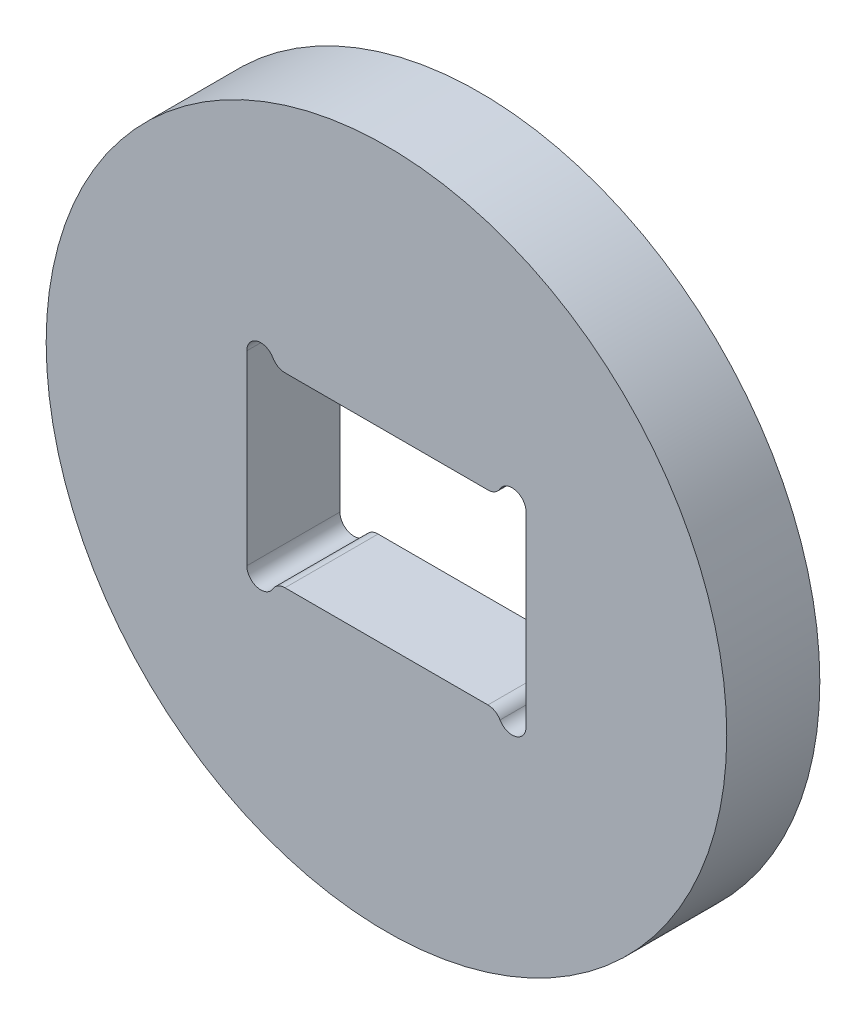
ISO-10303-21;
HEADER;
FILE_DESCRIPTION(('STEP AP214'),'2;1');
FILE_NAME('part.step','',(''),(''),'','','');
FILE_SCHEMA(('AUTOMOTIVE_DESIGN { 1 0 10303 214 1 1 1 1 }'));
ENDSEC;
DATA;
#1=APPLICATION_CONTEXT('core data for automotive mechanical design processes');
#2=APPLICATION_PROTOCOL_DEFINITION('international standard','automotive_design',2000,#1);
#3=PRODUCT_CONTEXT('',#1,'mechanical');
#4=PRODUCT('Part','Part','',(#3));
#5=PRODUCT_RELATED_PRODUCT_CATEGORY('part','',(#4));
#6=PRODUCT_DEFINITION_FORMATION('','',#4);
#7=PRODUCT_DEFINITION_CONTEXT('part definition',#1,'design');
#8=PRODUCT_DEFINITION('design','',#6,#7);
#9=PRODUCT_DEFINITION_SHAPE('','',#8);
#10=(LENGTH_UNIT() NAMED_UNIT(*) SI_UNIT(.MILLI.,.METRE.));
#11=(NAMED_UNIT(*) PLANE_ANGLE_UNIT() SI_UNIT($,.RADIAN.));
#12=(NAMED_UNIT(*) SI_UNIT($,.STERADIAN.) SOLID_ANGLE_UNIT());
#13=UNCERTAINTY_MEASURE_WITH_UNIT(LENGTH_MEASURE(1.E-05),#10,'distance_accuracy_value','');
#14=(GEOMETRIC_REPRESENTATION_CONTEXT(3) GLOBAL_UNCERTAINTY_ASSIGNED_CONTEXT((#13)) GLOBAL_UNIT_ASSIGNED_CONTEXT((#10,
#11,#12)) REPRESENTATION_CONTEXT('',''));
#15=CARTESIAN_POINT('',(0.,0.,0.));
#16=DIRECTION('',(0.,0.,1.));
#17=DIRECTION('',(1.,0.,0.));
#18=AXIS2_PLACEMENT_3D('',#15,#16,#17);
#19=CARTESIAN_POINT('',(-62.0464763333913,20.0201457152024,10.));
#20=DIRECTION('',(0.,0.,1.));
#21=DIRECTION('',(1.,0.,0.));
#22=AXIS2_PLACEMENT_3D('',#19,#20,#21);
#23=PLANE('',#22);
#24=CARTESIAN_POINT('',(-62.0464763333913,20.0201457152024,10.));
#25=DIRECTION('',(0.,0.,1.));
#26=DIRECTION('',(1.,0.,0.));
#27=AXIS2_PLACEMENT_3D('',#24,#25,#26);
#28=CIRCLE('',#27,36.56);
#29=CARTESIAN_POINT('',(-25.4864763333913,20.0201457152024,10.));
#30=VERTEX_POINT('',#29);
#31=EDGE_CURVE('E11',#30,#30,#28,.T.);
#32=ORIENTED_EDGE('',*,*,#31,.T.);
#33=EDGE_LOOP('',(#32));
#34=FACE_BOUND('',#33,.T.);
#35=DIRECTION('',(-1.,0.,0.));
#36=VECTOR('',#35,1.);
#37=CARTESIAN_POINT('',(-72.948400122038,30.0201457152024,10.));
#38=LINE('',#37,#36);
#39=CARTESIAN_POINT('',(-51.1445525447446,30.0201457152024,10.));
#40=VERTEX_POINT('',#39);
#41=CARTESIAN_POINT('',(-72.948400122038,30.0201457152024,10.));
#42=VERTEX_POINT('',#41);
#43=EDGE_CURVE('E144',#40,#42,#38,.T.);
#44=ORIENTED_EDGE('',*,*,#43,.F.);
#45=CARTESIAN_POINT('',(-51.1445525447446,31.5201457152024,10.));
#46=DIRECTION('',(0.,0.,-1.));
#47=DIRECTION('',(1.,0.,0.));
#48=AXIS2_PLACEMENT_3D('',#45,#46,#47);
#49=CIRCLE('',#48,1.5);
#50=CARTESIAN_POINT('',(-49.8455144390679,30.7701457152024,10.));
#51=VERTEX_POINT('',#50);
#52=EDGE_CURVE('E135',#51,#40,#49,.T.);
#53=ORIENTED_EDGE('',*,*,#52,.F.);
#54=CARTESIAN_POINT('',(-48.5464763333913,30.0201457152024,10.));
#55=DIRECTION('',(0.,0.,1.));
#56=DIRECTION('',(1.,0.,0.));
#57=AXIS2_PLACEMENT_3D('',#54,#55,#56);
#58=CIRCLE('',#57,1.5);
#59=CARTESIAN_POINT('',(-47.0464763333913,30.0201457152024,10.));
#60=VERTEX_POINT('',#59);
#61=EDGE_CURVE('E187',#60,#51,#58,.T.);
#62=ORIENTED_EDGE('',*,*,#61,.F.);
#63=DIRECTION('',(0.,1.,0.));
#64=VECTOR('',#63,1.);
#65=CARTESIAN_POINT('',(-47.0464763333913,30.0201457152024,10.));
#66=LINE('',#65,#64);
#67=CARTESIAN_POINT('',(-47.0464763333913,10.0201457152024,10.));
#68=VERTEX_POINT('',#67);
#69=EDGE_CURVE('E184',#68,#60,#66,.T.);
#70=ORIENTED_EDGE('',*,*,#69,.F.);
#71=CARTESIAN_POINT('',(-48.5464763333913,10.0201457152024,10.));
#72=DIRECTION('',(0.,0.,1.));
#73=DIRECTION('',(1.,0.,0.));
#74=AXIS2_PLACEMENT_3D('',#71,#72,#73);
#75=CIRCLE('',#74,1.5);
#76=CARTESIAN_POINT('',(-49.8455144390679,9.27014571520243,10.));
#77=VERTEX_POINT('',#76);
#78=EDGE_CURVE('E181',#77,#68,#75,.T.);
#79=ORIENTED_EDGE('',*,*,#78,.F.);
#80=CARTESIAN_POINT('',(-51.1445525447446,8.52014571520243,10.));
#81=DIRECTION('',(0.,0.,-1.));
#82=DIRECTION('',(1.,0.,0.));
#83=AXIS2_PLACEMENT_3D('',#80,#81,#82);
#84=CIRCLE('',#83,1.5);
#85=CARTESIAN_POINT('',(-51.1445525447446,10.0201457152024,10.));
#86=VERTEX_POINT('',#85);
#87=EDGE_CURVE('E178',#86,#77,#84,.T.);
#88=ORIENTED_EDGE('',*,*,#87,.F.);
#89=DIRECTION('',(1.,0.,0.));
#90=VECTOR('',#89,1.);
#91=CARTESIAN_POINT('',(-51.1445525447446,10.0201457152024,10.));
#92=LINE('',#91,#90);
#93=CARTESIAN_POINT('',(-72.948400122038,10.0201457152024,10.));
#94=VERTEX_POINT('',#93);
#95=EDGE_CURVE('E175',#94,#86,#92,.T.);
#96=ORIENTED_EDGE('',*,*,#95,.F.);
#97=CARTESIAN_POINT('',(-72.948400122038,8.52014571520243,10.));
#98=DIRECTION('',(0.,0.,-1.));
#99=DIRECTION('',(1.,0.,0.));
#100=AXIS2_PLACEMENT_3D('',#97,#98,#99);
#101=CIRCLE('',#100,1.5);
#102=CARTESIAN_POINT('',(-74.2474382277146,9.27014571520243,10.));
#103=VERTEX_POINT('',#102);
#104=EDGE_CURVE('E172',#103,#94,#101,.T.);
#105=ORIENTED_EDGE('',*,*,#104,.F.);
#106=CARTESIAN_POINT('',(-75.5464763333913,10.0201457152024,10.));
#107=DIRECTION('',(0.,0.,1.));
#108=DIRECTION('',(1.,0.,0.));
#109=AXIS2_PLACEMENT_3D('',#106,#107,#108);
#110=CIRCLE('',#109,1.5);
#111=CARTESIAN_POINT('',(-77.0464763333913,10.0201457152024,10.));
#112=VERTEX_POINT('',#111);
#113=EDGE_CURVE('E169',#112,#103,#110,.T.);
#114=ORIENTED_EDGE('',*,*,#113,.F.);
#115=DIRECTION('',(0.,-1.,0.));
#116=VECTOR('',#115,1.);
#117=CARTESIAN_POINT('',(-77.0464763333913,10.0201457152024,10.));
#118=LINE('',#117,#116);
#119=CARTESIAN_POINT('',(-77.0464763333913,30.0201457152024,10.));
#120=VERTEX_POINT('',#119);
#121=EDGE_CURVE('E166',#120,#112,#118,.T.);
#122=ORIENTED_EDGE('',*,*,#121,.F.);
#123=CARTESIAN_POINT('',(-75.5464763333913,30.0201457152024,10.));
#124=DIRECTION('',(0.,0.,1.));
#125=DIRECTION('',(1.,0.,0.));
#126=AXIS2_PLACEMENT_3D('',#123,#124,#125);
#127=CIRCLE('',#126,1.5);
#128=CARTESIAN_POINT('',(-74.2474382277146,30.7701457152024,10.));
#129=VERTEX_POINT('',#128);
#130=EDGE_CURVE('E161',#129,#120,#127,.T.);
#131=ORIENTED_EDGE('',*,*,#130,.F.);
#132=CARTESIAN_POINT('',(-72.948400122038,31.5201457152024,10.));
#133=DIRECTION('',(0.,0.,-1.));
#134=DIRECTION('',(1.,0.,0.));
#135=AXIS2_PLACEMENT_3D('',#132,#133,#134);
#136=CIRCLE('',#135,1.5);
#137=EDGE_CURVE('E157',#42,#129,#136,.T.);
#138=ORIENTED_EDGE('',*,*,#137,.F.);
#139=EDGE_LOOP('',(#44,#53,#62,#70,#79,#88,#96,#105,#114,#122,#131,#138));
#140=FACE_BOUND('',#139,.T.);
#141=ADVANCED_FACE('F45',(#34,#140),#23,.T.);
#142=CARTESIAN_POINT('',(-62.0464763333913,20.0201457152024,0.));
#143=DIRECTION('',(0.,0.,1.));
#144=DIRECTION('',(1.,0.,0.));
#145=AXIS2_PLACEMENT_3D('',#142,#143,#144);
#146=PLANE('',#145);
#147=CARTESIAN_POINT('',(-62.0464763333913,20.0201457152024,0.));
#148=DIRECTION('',(0.,0.,1.));
#149=DIRECTION('',(1.,0.,0.));
#150=AXIS2_PLACEMENT_3D('',#147,#148,#149);
#151=CIRCLE('',#150,36.56);
#152=CARTESIAN_POINT('',(-25.4864763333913,20.0201457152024,0.));
#153=VERTEX_POINT('',#152);
#154=EDGE_CURVE('E49',#153,#153,#151,.T.);
#155=ORIENTED_EDGE('',*,*,#154,.F.);
#156=EDGE_LOOP('',(#155));
#157=FACE_BOUND('',#156,.T.);
#158=CARTESIAN_POINT('',(-51.1445525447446,31.5201457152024,0.));
#159=DIRECTION('',(0.,0.,-1.));
#160=DIRECTION('',(1.,0.,0.));
#161=AXIS2_PLACEMENT_3D('',#158,#159,#160);
#162=CIRCLE('',#161,1.5);
#163=CARTESIAN_POINT('',(-49.8455144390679,30.7701457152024,0.));
#164=VERTEX_POINT('',#163);
#165=CARTESIAN_POINT('',(-51.1445525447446,30.0201457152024,0.));
#166=VERTEX_POINT('',#165);
#167=EDGE_CURVE('E69',#164,#166,#162,.T.);
#168=ORIENTED_EDGE('',*,*,#167,.T.);
#169=DIRECTION('',(-1.,0.,0.));
#170=VECTOR('',#169,1.);
#171=CARTESIAN_POINT('',(-72.948400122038,30.0201457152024,0.));
#172=LINE('',#171,#170);
#173=CARTESIAN_POINT('',(-72.948400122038,30.0201457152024,0.));
#174=VERTEX_POINT('',#173);
#175=EDGE_CURVE('E151',#166,#174,#172,.T.);
#176=ORIENTED_EDGE('',*,*,#175,.T.);
#177=CARTESIAN_POINT('',(-72.948400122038,31.5201457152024,0.));
#178=DIRECTION('',(0.,0.,-1.));
#179=DIRECTION('',(1.,0.,0.));
#180=AXIS2_PLACEMENT_3D('',#177,#178,#179);
#181=CIRCLE('',#180,1.5);
#182=CARTESIAN_POINT('',(-74.2474382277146,30.7701457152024,0.));
#183=VERTEX_POINT('',#182);
#184=EDGE_CURVE('E194',#174,#183,#181,.T.);
#185=ORIENTED_EDGE('',*,*,#184,.T.);
#186=CARTESIAN_POINT('',(-75.5464763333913,30.0201457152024,0.));
#187=DIRECTION('',(0.,0.,1.));
#188=DIRECTION('',(1.,0.,0.));
#189=AXIS2_PLACEMENT_3D('',#186,#187,#188);
#190=CIRCLE('',#189,1.5);
#191=CARTESIAN_POINT('',(-77.0464763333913,30.0201457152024,0.));
#192=VERTEX_POINT('',#191);
#193=EDGE_CURVE('E198',#183,#192,#190,.T.);
#194=ORIENTED_EDGE('',*,*,#193,.T.);
#195=DIRECTION('',(0.,-1.,0.));
#196=VECTOR('',#195,1.);
#197=CARTESIAN_POINT('',(-77.0464763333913,10.0201457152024,0.));
#198=LINE('',#197,#196);
#199=CARTESIAN_POINT('',(-77.0464763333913,10.0201457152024,0.));
#200=VERTEX_POINT('',#199);
#201=EDGE_CURVE('E202',#192,#200,#198,.T.);
#202=ORIENTED_EDGE('',*,*,#201,.T.);
#203=CARTESIAN_POINT('',(-75.5464763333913,10.0201457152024,0.));
#204=DIRECTION('',(0.,0.,1.));
#205=DIRECTION('',(1.,0.,0.));
#206=AXIS2_PLACEMENT_3D('',#203,#204,#205);
#207=CIRCLE('',#206,1.5);
#208=CARTESIAN_POINT('',(-74.2474382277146,9.27014571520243,0.));
#209=VERTEX_POINT('',#208);
#210=EDGE_CURVE('E206',#200,#209,#207,.T.);
#211=ORIENTED_EDGE('',*,*,#210,.T.);
#212=CARTESIAN_POINT('',(-72.948400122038,8.52014571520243,0.));
#213=DIRECTION('',(0.,0.,-1.));
#214=DIRECTION('',(1.,0.,0.));
#215=AXIS2_PLACEMENT_3D('',#212,#213,#214);
#216=CIRCLE('',#215,1.5);
#217=CARTESIAN_POINT('',(-72.948400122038,10.0201457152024,0.));
#218=VERTEX_POINT('',#217);
#219=EDGE_CURVE('E210',#209,#218,#216,.T.);
#220=ORIENTED_EDGE('',*,*,#219,.T.);
#221=DIRECTION('',(1.,0.,0.));
#222=VECTOR('',#221,1.);
#223=CARTESIAN_POINT('',(-51.1445525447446,10.0201457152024,0.));
#224=LINE('',#223,#222);
#225=CARTESIAN_POINT('',(-51.1445525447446,10.0201457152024,0.));
#226=VERTEX_POINT('',#225);
#227=EDGE_CURVE('E214',#218,#226,#224,.T.);
#228=ORIENTED_EDGE('',*,*,#227,.T.);
#229=CARTESIAN_POINT('',(-51.1445525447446,8.52014571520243,0.));
#230=DIRECTION('',(0.,0.,-1.));
#231=DIRECTION('',(1.,0.,0.));
#232=AXIS2_PLACEMENT_3D('',#229,#230,#231);
#233=CIRCLE('',#232,1.5);
#234=CARTESIAN_POINT('',(-49.8455144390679,9.27014571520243,0.));
#235=VERTEX_POINT('',#234);
#236=EDGE_CURVE('E218',#226,#235,#233,.T.);
#237=ORIENTED_EDGE('',*,*,#236,.T.);
#238=CARTESIAN_POINT('',(-48.5464763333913,10.0201457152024,0.));
#239=DIRECTION('',(0.,0.,1.));
#240=DIRECTION('',(1.,0.,0.));
#241=AXIS2_PLACEMENT_3D('',#238,#239,#240);
#242=CIRCLE('',#241,1.5);
#243=CARTESIAN_POINT('',(-47.0464763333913,10.0201457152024,0.));
#244=VERTEX_POINT('',#243);
#245=EDGE_CURVE('E222',#235,#244,#242,.T.);
#246=ORIENTED_EDGE('',*,*,#245,.T.);
#247=DIRECTION('',(0.,1.,0.));
#248=VECTOR('',#247,1.);
#249=CARTESIAN_POINT('',(-47.0464763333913,30.0201457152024,0.));
#250=LINE('',#249,#248);
#251=CARTESIAN_POINT('',(-47.0464763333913,30.0201457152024,0.));
#252=VERTEX_POINT('',#251);
#253=EDGE_CURVE('E226',#244,#252,#250,.T.);
#254=ORIENTED_EDGE('',*,*,#253,.T.);
#255=CARTESIAN_POINT('',(-48.5464763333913,30.0201457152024,0.));
#256=DIRECTION('',(0.,0.,1.));
#257=DIRECTION('',(1.,0.,0.));
#258=AXIS2_PLACEMENT_3D('',#255,#256,#257);
#259=CIRCLE('',#258,1.5);
#260=EDGE_CURVE('E145',#252,#164,#259,.T.);
#261=ORIENTED_EDGE('',*,*,#260,.T.);
#262=EDGE_LOOP('',(#168,#176,#185,#194,#202,#211,#220,#228,#237,#246,#254,#261));
#263=FACE_BOUND('',#262,.T.);
#264=ADVANCED_FACE('F268',(#157,#263),#146,.F.);
#265=CARTESIAN_POINT('',(-62.0464763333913,20.0201457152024,10.));
#266=DIRECTION('',(0.,0.,-1.));
#267=DIRECTION('',(-1.,0.,0.));
#268=AXIS2_PLACEMENT_3D('',#265,#266,#267);
#269=CYLINDRICAL_SURFACE('',#268,36.56);
#270=ORIENTED_EDGE('',*,*,#31,.F.);
#271=EDGE_LOOP('',(#270));
#272=FACE_BOUND('',#271,.T.);
#273=ORIENTED_EDGE('',*,*,#154,.T.);
#274=EDGE_LOOP('',(#273));
#275=FACE_BOUND('',#274,.T.);
#276=ADVANCED_FACE('F47',(#272,#275),#269,.T.);
#277=CARTESIAN_POINT('',(-51.1445525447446,31.5201457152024,10.));
#278=DIRECTION('',(0.,0.,-1.));
#279=DIRECTION('',(-1.,0.,0.));
#280=AXIS2_PLACEMENT_3D('',#277,#278,#279);
#281=CYLINDRICAL_SURFACE('',#280,1.5);
#282=ORIENTED_EDGE('',*,*,#167,.F.);
#283=DIRECTION('',(0.,0.,-1.));
#284=VECTOR('',#283,1.);
#285=CARTESIAN_POINT('',(-49.8455144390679,30.7701457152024,10.));
#286=LINE('',#285,#284);
#287=EDGE_CURVE('E139',#51,#164,#286,.T.);
#288=ORIENTED_EDGE('',*,*,#287,.F.);
#289=ORIENTED_EDGE('',*,*,#52,.T.);
#290=DIRECTION('',(0.,0.,-1.));
#291=VECTOR('',#290,1.);
#292=CARTESIAN_POINT('',(-51.1445525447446,30.0201457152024,10.));
#293=LINE('',#292,#291);
#294=EDGE_CURVE('E138',#40,#166,#293,.T.);
#295=ORIENTED_EDGE('',*,*,#294,.T.);
#296=EDGE_LOOP('',(#282,#288,#289,#295));
#297=FACE_BOUND('',#296,.T.);
#298=ADVANCED_FACE('F137',(#297),#281,.T.);
#299=CARTESIAN_POINT('',(-72.948400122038,30.0201457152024,10.));
#300=DIRECTION('',(0.,-1.,0.));
#301=DIRECTION('',(0.,0.,-1.));
#302=AXIS2_PLACEMENT_3D('',#299,#300,#301);
#303=PLANE('',#302);
#304=ORIENTED_EDGE('',*,*,#175,.F.);
#305=ORIENTED_EDGE('',*,*,#294,.F.);
#306=ORIENTED_EDGE('',*,*,#43,.T.);
#307=DIRECTION('',(0.,0.,-1.));
#308=VECTOR('',#307,1.);
#309=CARTESIAN_POINT('',(-72.948400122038,30.0201457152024,10.));
#310=LINE('',#309,#308);
#311=EDGE_CURVE('E153',#42,#174,#310,.T.);
#312=ORIENTED_EDGE('',*,*,#311,.T.);
#313=EDGE_LOOP('',(#304,#305,#306,#312));
#314=FACE_BOUND('',#313,.T.);
#315=ADVANCED_FACE('F148',(#314),#303,.T.);
#316=CARTESIAN_POINT('',(-72.948400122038,31.5201457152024,10.));
#317=DIRECTION('',(0.,0.,-1.));
#318=DIRECTION('',(-1.,0.,0.));
#319=AXIS2_PLACEMENT_3D('',#316,#317,#318);
#320=CYLINDRICAL_SURFACE('',#319,1.5);
#321=ORIENTED_EDGE('',*,*,#184,.F.);
#322=ORIENTED_EDGE('',*,*,#311,.F.);
#323=ORIENTED_EDGE('',*,*,#137,.T.);
#324=DIRECTION('',(0.,0.,-1.));
#325=VECTOR('',#324,1.);
#326=CARTESIAN_POINT('',(-74.2474382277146,30.7701457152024,10.));
#327=LINE('',#326,#325);
#328=EDGE_CURVE('E258',#129,#183,#327,.T.);
#329=ORIENTED_EDGE('',*,*,#328,.T.);
#330=EDGE_LOOP('',(#321,#322,#323,#329));
#331=FACE_BOUND('',#330,.T.);
#332=ADVANCED_FACE('F264',(#331),#320,.T.);
#333=CARTESIAN_POINT('',(-75.5464763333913,30.0201457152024,10.));
#334=DIRECTION('',(0.,0.,-1.));
#335=DIRECTION('',(-1.,0.,0.));
#336=AXIS2_PLACEMENT_3D('',#333,#334,#335);
#337=CYLINDRICAL_SURFACE('',#336,1.5);
#338=ORIENTED_EDGE('',*,*,#193,.F.);
#339=ORIENTED_EDGE('',*,*,#328,.F.);
#340=ORIENTED_EDGE('',*,*,#130,.T.);
#341=DIRECTION('',(0.,0.,-1.));
#342=VECTOR('',#341,1.);
#343=CARTESIAN_POINT('',(-77.0464763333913,30.0201457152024,10.));
#344=LINE('',#343,#342);
#345=EDGE_CURVE('E255',#120,#192,#344,.T.);
#346=ORIENTED_EDGE('',*,*,#345,.T.);
#347=EDGE_LOOP('',(#338,#339,#340,#346));
#348=FACE_BOUND('',#347,.T.);
#349=ADVANCED_FACE('F306',(#348),#337,.F.);
#350=CARTESIAN_POINT('',(-77.0464763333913,10.0201457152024,10.));
#351=DIRECTION('',(1.,0.,0.));
#352=DIRECTION('',(0.,1.,0.));
#353=AXIS2_PLACEMENT_3D('',#350,#351,#352);
#354=PLANE('',#353);
#355=ORIENTED_EDGE('',*,*,#201,.F.);
#356=ORIENTED_EDGE('',*,*,#345,.F.);
#357=ORIENTED_EDGE('',*,*,#121,.T.);
#358=DIRECTION('',(0.,0.,-1.));
#359=VECTOR('',#358,1.);
#360=CARTESIAN_POINT('',(-77.0464763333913,10.0201457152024,10.));
#361=LINE('',#360,#359);
#362=EDGE_CURVE('E252',#112,#200,#361,.T.);
#363=ORIENTED_EDGE('',*,*,#362,.T.);
#364=EDGE_LOOP('',(#355,#356,#357,#363));
#365=FACE_BOUND('',#364,.T.);
#366=ADVANCED_FACE('F304',(#365),#354,.T.);
#367=CARTESIAN_POINT('',(-75.5464763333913,10.0201457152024,10.));
#368=DIRECTION('',(0.,0.,-1.));
#369=DIRECTION('',(-1.,0.,0.));
#370=AXIS2_PLACEMENT_3D('',#367,#368,#369);
#371=CYLINDRICAL_SURFACE('',#370,1.5);
#372=ORIENTED_EDGE('',*,*,#210,.F.);
#373=ORIENTED_EDGE('',*,*,#362,.F.);
#374=ORIENTED_EDGE('',*,*,#113,.T.);
#375=DIRECTION('',(0.,0.,-1.));
#376=VECTOR('',#375,1.);
#377=CARTESIAN_POINT('',(-74.2474382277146,9.27014571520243,10.));
#378=LINE('',#377,#376);
#379=EDGE_CURVE('E249',#103,#209,#378,.T.);
#380=ORIENTED_EDGE('',*,*,#379,.T.);
#381=EDGE_LOOP('',(#372,#373,#374,#380));
#382=FACE_BOUND('',#381,.T.);
#383=ADVANCED_FACE('F298',(#382),#371,.F.);
#384=CARTESIAN_POINT('',(-72.948400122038,8.52014571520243,10.));
#385=DIRECTION('',(0.,0.,-1.));
#386=DIRECTION('',(-1.,0.,0.));
#387=AXIS2_PLACEMENT_3D('',#384,#385,#386);
#388=CYLINDRICAL_SURFACE('',#387,1.5);
#389=ORIENTED_EDGE('',*,*,#219,.F.);
#390=ORIENTED_EDGE('',*,*,#379,.F.);
#391=ORIENTED_EDGE('',*,*,#104,.T.);
#392=DIRECTION('',(0.,0.,-1.));
#393=VECTOR('',#392,1.);
#394=CARTESIAN_POINT('',(-72.948400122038,10.0201457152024,10.));
#395=LINE('',#394,#393);
#396=EDGE_CURVE('E246',#94,#218,#395,.T.);
#397=ORIENTED_EDGE('',*,*,#396,.T.);
#398=EDGE_LOOP('',(#389,#390,#391,#397));
#399=FACE_BOUND('',#398,.T.);
#400=ADVANCED_FACE('F294',(#399),#388,.T.);
#401=CARTESIAN_POINT('',(-51.1445525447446,10.0201457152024,10.));
#402=DIRECTION('',(0.,1.,0.));
#403=DIRECTION('',(-1.,0.,0.));
#404=AXIS2_PLACEMENT_3D('',#401,#402,#403);
#405=PLANE('',#404);
#406=ORIENTED_EDGE('',*,*,#227,.F.);
#407=ORIENTED_EDGE('',*,*,#396,.F.);
#408=ORIENTED_EDGE('',*,*,#95,.T.);
#409=DIRECTION('',(0.,0.,-1.));
#410=VECTOR('',#409,1.);
#411=CARTESIAN_POINT('',(-51.1445525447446,10.0201457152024,10.));
#412=LINE('',#411,#410);
#413=EDGE_CURVE('E243',#86,#226,#412,.T.);
#414=ORIENTED_EDGE('',*,*,#413,.T.);
#415=EDGE_LOOP('',(#406,#407,#408,#414));
#416=FACE_BOUND('',#415,.T.);
#417=ADVANCED_FACE('F291',(#416),#405,.T.);
#418=CARTESIAN_POINT('',(-51.1445525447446,8.52014571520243,10.));
#419=DIRECTION('',(0.,0.,-1.));
#420=DIRECTION('',(-1.,0.,0.));
#421=AXIS2_PLACEMENT_3D('',#418,#419,#420);
#422=CYLINDRICAL_SURFACE('',#421,1.5);
#423=ORIENTED_EDGE('',*,*,#236,.F.);
#424=ORIENTED_EDGE('',*,*,#413,.F.);
#425=ORIENTED_EDGE('',*,*,#87,.T.);
#426=DIRECTION('',(0.,0.,-1.));
#427=VECTOR('',#426,1.);
#428=CARTESIAN_POINT('',(-49.8455144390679,9.27014571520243,10.));
#429=LINE('',#428,#427);
#430=EDGE_CURVE('E240',#77,#235,#429,.T.);
#431=ORIENTED_EDGE('',*,*,#430,.T.);
#432=EDGE_LOOP('',(#423,#424,#425,#431));
#433=FACE_BOUND('',#432,.T.);
#434=ADVANCED_FACE('F283',(#433),#422,.T.);
#435=CARTESIAN_POINT('',(-48.5464763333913,10.0201457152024,10.));
#436=DIRECTION('',(0.,0.,-1.));
#437=DIRECTION('',(-1.,0.,0.));
#438=AXIS2_PLACEMENT_3D('',#435,#436,#437);
#439=CYLINDRICAL_SURFACE('',#438,1.5);
#440=ORIENTED_EDGE('',*,*,#245,.F.);
#441=ORIENTED_EDGE('',*,*,#430,.F.);
#442=ORIENTED_EDGE('',*,*,#78,.T.);
#443=DIRECTION('',(0.,0.,-1.));
#444=VECTOR('',#443,1.);
#445=CARTESIAN_POINT('',(-47.0464763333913,10.0201457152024,10.));
#446=LINE('',#445,#444);
#447=EDGE_CURVE('E237',#68,#244,#446,.T.);
#448=ORIENTED_EDGE('',*,*,#447,.T.);
#449=EDGE_LOOP('',(#440,#441,#442,#448));
#450=FACE_BOUND('',#449,.T.);
#451=ADVANCED_FACE('F279',(#450),#439,.F.);
#452=CARTESIAN_POINT('',(-47.0464763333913,30.0201457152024,10.));
#453=DIRECTION('',(-1.,0.,0.));
#454=DIRECTION('',(0.,-1.,0.));
#455=AXIS2_PLACEMENT_3D('',#452,#453,#454);
#456=PLANE('',#455);
#457=ORIENTED_EDGE('',*,*,#253,.F.);
#458=ORIENTED_EDGE('',*,*,#447,.F.);
#459=ORIENTED_EDGE('',*,*,#69,.T.);
#460=DIRECTION('',(0.,0.,-1.));
#461=VECTOR('',#460,1.);
#462=CARTESIAN_POINT('',(-47.0464763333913,30.0201457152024,10.));
#463=LINE('',#462,#461);
#464=EDGE_CURVE('E61',#60,#252,#463,.T.);
#465=ORIENTED_EDGE('',*,*,#464,.T.);
#466=EDGE_LOOP('',(#457,#458,#459,#465));
#467=FACE_BOUND('',#466,.T.);
#468=ADVANCED_FACE('F276',(#467),#456,.T.);
#469=CARTESIAN_POINT('',(-48.5464763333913,30.0201457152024,10.));
#470=DIRECTION('',(0.,0.,-1.));
#471=DIRECTION('',(-1.,0.,0.));
#472=AXIS2_PLACEMENT_3D('',#469,#470,#471);
#473=CYLINDRICAL_SURFACE('',#472,1.5);
#474=ORIENTED_EDGE('',*,*,#260,.F.);
#475=ORIENTED_EDGE('',*,*,#464,.F.);
#476=ORIENTED_EDGE('',*,*,#61,.T.);
#477=ORIENTED_EDGE('',*,*,#287,.T.);
#478=EDGE_LOOP('',(#474,#475,#476,#477));
#479=FACE_BOUND('',#478,.T.);
#480=ADVANCED_FACE('F270',(#479),#473,.F.);
#481=CLOSED_SHELL('',(#141,#264,#276,#298,#315,#332,#349,#366,#383,#400,#417,#434,#451,#468,#480));
#482=MANIFOLD_SOLID_BREP('B2',#481);
#483=ADVANCED_BREP_SHAPE_REPRESENTATION('',(#18,#482),#14);
#484=SHAPE_DEFINITION_REPRESENTATION(#9,#483);
ENDSEC;
END-ISO-10303-21;
